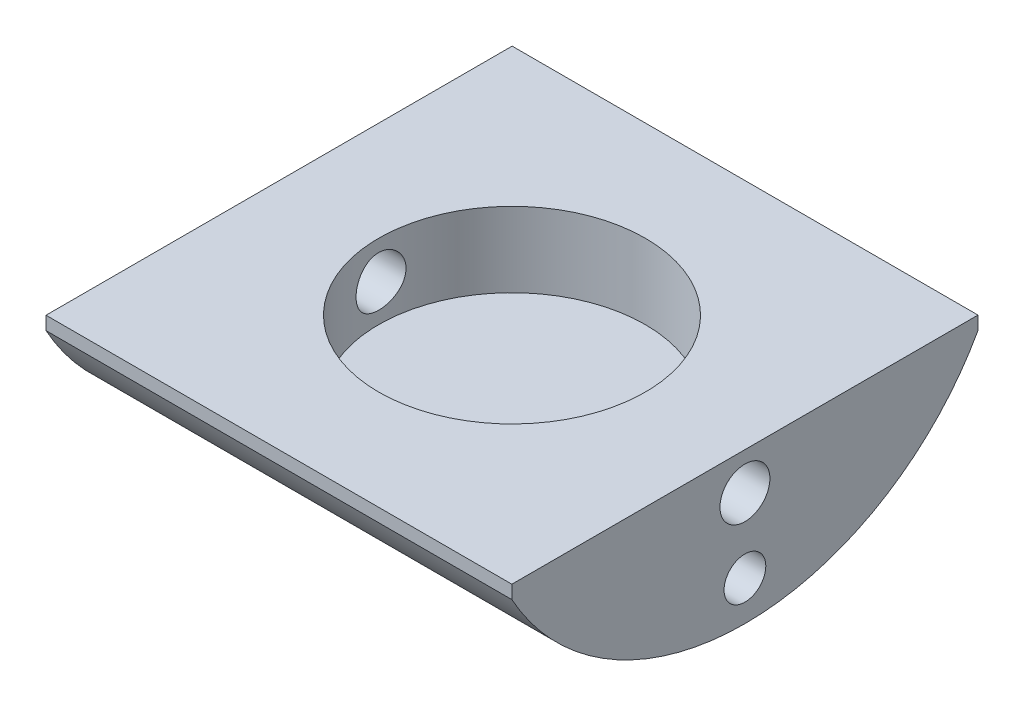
ISO-10303-21;
HEADER;
FILE_DESCRIPTION(('STEP AP214'),'2;1');
FILE_NAME('part.step','',(''),(''),'','','');
FILE_SCHEMA(('AUTOMOTIVE_DESIGN { 1 0 10303 214 1 1 1 1 }'));
ENDSEC;
DATA;
#1=APPLICATION_CONTEXT('core data for automotive mechanical design processes');
#2=APPLICATION_PROTOCOL_DEFINITION('international standard','automotive_design',2000,#1);
#3=PRODUCT_CONTEXT('',#1,'mechanical');
#4=PRODUCT('Part','Part','',(#3));
#5=PRODUCT_RELATED_PRODUCT_CATEGORY('part','',(#4));
#6=PRODUCT_DEFINITION_FORMATION('','',#4);
#7=PRODUCT_DEFINITION_CONTEXT('part definition',#1,'design');
#8=PRODUCT_DEFINITION('design','',#6,#7);
#9=PRODUCT_DEFINITION_SHAPE('','',#8);
#10=(LENGTH_UNIT() NAMED_UNIT(*) SI_UNIT(.MILLI.,.METRE.));
#11=(NAMED_UNIT(*) PLANE_ANGLE_UNIT() SI_UNIT($,.RADIAN.));
#12=(NAMED_UNIT(*) SI_UNIT($,.STERADIAN.) SOLID_ANGLE_UNIT());
#13=UNCERTAINTY_MEASURE_WITH_UNIT(LENGTH_MEASURE(1.E-05),#10,'distance_accuracy_value','');
#14=(GEOMETRIC_REPRESENTATION_CONTEXT(3) GLOBAL_UNCERTAINTY_ASSIGNED_CONTEXT((#13)) GLOBAL_UNIT_ASSIGNED_CONTEXT((#10,
#11,#12)) REPRESENTATION_CONTEXT('',''));
#15=CARTESIAN_POINT('',(0.,0.,0.));
#16=DIRECTION('',(0.,0.,1.));
#17=DIRECTION('',(1.,0.,0.));
#18=AXIS2_PLACEMENT_3D('',#15,#16,#17);
#19=CARTESIAN_POINT('',(44.4246000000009,0.,44.45));
#20=DIRECTION('',(0.,0.,-1.));
#21=DIRECTION('',(0.,1.00000000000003,0.));
#22=AXIS2_PLACEMENT_3D('',#19,#20,#21);
#23=PLANE('',#22);
#24=DIRECTION('',(0.,-1.00000000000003,0.));
#25=VECTOR('',#24,1.);
#26=CARTESIAN_POINT('',(-44.4246000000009,0.,44.45));
#27=LINE('',#26,#25);
#28=CARTESIAN_POINT('',(-44.4246000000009,0.,44.45));
#29=VERTEX_POINT('',#28);
#30=CARTESIAN_POINT('',(-44.4246000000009,-2.54624424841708,44.45));
#31=VERTEX_POINT('',#30);
#32=EDGE_CURVE('E120',#29,#31,#27,.T.);
#33=ORIENTED_EDGE('',*,*,#32,.T.);
#34=DIRECTION('',(-1.00000000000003,0.,0.));
#35=VECTOR('',#34,1.);
#36=CARTESIAN_POINT('',(44.4246000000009,-2.54624424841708,44.45));
#37=LINE('',#36,#35);
#38=CARTESIAN_POINT('',(44.4246000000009,-2.54624424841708,44.45));
#39=VERTEX_POINT('',#38);
#40=EDGE_CURVE('E11',#39,#31,#37,.T.);
#41=ORIENTED_EDGE('',*,*,#40,.F.);
#42=DIRECTION('',(0.,-1.00000000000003,0.));
#43=VECTOR('',#42,1.);
#44=CARTESIAN_POINT('',(44.4246000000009,0.,44.45));
#45=LINE('',#44,#43);
#46=CARTESIAN_POINT('',(44.4246000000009,0.,44.45));
#47=VERTEX_POINT('',#46);
#48=EDGE_CURVE('E129',#47,#39,#45,.T.);
#49=ORIENTED_EDGE('',*,*,#48,.F.);
#50=DIRECTION('',(-1.00000000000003,0.,0.));
#51=VECTOR('',#50,1.);
#52=CARTESIAN_POINT('',(44.4246000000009,0.,44.45));
#53=LINE('',#52,#51);
#54=EDGE_CURVE('E135',#47,#29,#53,.T.);
#55=ORIENTED_EDGE('',*,*,#54,.T.);
#56=EDGE_LOOP('',(#33,#41,#49,#55));
#57=FACE_BOUND('',#56,.T.);
#58=ADVANCED_FACE('F36',(#57),#23,.F.);
#59=CARTESIAN_POINT('',(44.4246000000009,22.0472,0.));
#60=DIRECTION('',(-1.00000000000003,0.,0.));
#61=DIRECTION('',(0.,0.,1.));
#62=AXIS2_PLACEMENT_3D('',#59,#60,#61);
#63=CYLINDRICAL_SURFACE('',#62,50.8);
#64=CARTESIAN_POINT('',(-44.4246000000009,22.0472,0.));
#65=DIRECTION('',(1.00000000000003,0.,0.));
#66=DIRECTION('',(0.,0.,-1.));
#67=AXIS2_PLACEMENT_3D('',#64,#65,#66);
#68=CIRCLE('',#67,50.8);
#69=CARTESIAN_POINT('',(-44.4246000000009,-2.54624424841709,-44.45));
#70=VERTEX_POINT('',#69);
#71=EDGE_CURVE('E123',#31,#70,#68,.T.);
#72=ORIENTED_EDGE('',*,*,#71,.T.);
#73=DIRECTION('',(-1.00000000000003,0.,0.));
#74=VECTOR('',#73,1.);
#75=CARTESIAN_POINT('',(44.4246000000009,-2.54624424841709,-44.45));
#76=LINE('',#75,#74);
#77=CARTESIAN_POINT('',(44.4246000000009,-2.54624424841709,-44.45));
#78=VERTEX_POINT('',#77);
#79=EDGE_CURVE('E49',#78,#70,#76,.T.);
#80=ORIENTED_EDGE('',*,*,#79,.F.);
#81=CARTESIAN_POINT('',(44.4246000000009,22.0472,0.));
#82=DIRECTION('',(1.00000000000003,0.,0.));
#83=DIRECTION('',(0.,0.,-1.));
#84=AXIS2_PLACEMENT_3D('',#81,#82,#83);
#85=CIRCLE('',#84,50.8);
#86=EDGE_CURVE('E131',#39,#78,#85,.T.);
#87=ORIENTED_EDGE('',*,*,#86,.F.);
#88=ORIENTED_EDGE('',*,*,#40,.T.);
#89=EDGE_LOOP('',(#72,#80,#87,#88));
#90=FACE_BOUND('',#89,.T.);
#91=ADVANCED_FACE('F170',(#90),#63,.T.);
#92=CARTESIAN_POINT('',(44.4246000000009,-2.54624424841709,-44.45));
#93=DIRECTION('',(0.,0.,1.));
#94=DIRECTION('',(0.,-1.00000000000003,0.));
#95=AXIS2_PLACEMENT_3D('',#92,#93,#94);
#96=PLANE('',#95);
#97=DIRECTION('',(0.,1.00000000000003,0.));
#98=VECTOR('',#97,1.);
#99=CARTESIAN_POINT('',(-44.4246000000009,-2.54624424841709,-44.45));
#100=LINE('',#99,#98);
#101=CARTESIAN_POINT('',(-44.4246000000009,0.,-44.45));
#102=VERTEX_POINT('',#101);
#103=EDGE_CURVE('E125',#70,#102,#100,.T.);
#104=ORIENTED_EDGE('',*,*,#103,.T.);
#105=DIRECTION('',(-1.00000000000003,0.,0.));
#106=VECTOR('',#105,1.);
#107=CARTESIAN_POINT('',(44.4246000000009,0.,-44.45));
#108=LINE('',#107,#106);
#109=CARTESIAN_POINT('',(44.4246000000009,0.,-44.45));
#110=VERTEX_POINT('',#109);
#111=EDGE_CURVE('E138',#110,#102,#108,.T.);
#112=ORIENTED_EDGE('',*,*,#111,.F.);
#113=DIRECTION('',(0.,1.00000000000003,0.));
#114=VECTOR('',#113,1.);
#115=CARTESIAN_POINT('',(44.4246000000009,-2.54624424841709,-44.45));
#116=LINE('',#115,#114);
#117=EDGE_CURVE('E62',#78,#110,#116,.T.);
#118=ORIENTED_EDGE('',*,*,#117,.F.);
#119=ORIENTED_EDGE('',*,*,#79,.T.);
#120=EDGE_LOOP('',(#104,#112,#118,#119));
#121=FACE_BOUND('',#120,.T.);
#122=ADVANCED_FACE('F175',(#121),#96,.F.);
#123=CARTESIAN_POINT('',(44.4246000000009,0.,44.45));
#124=DIRECTION('',(0.,-1.00000000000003,0.));
#125=DIRECTION('',(0.,0.,-1.));
#126=AXIS2_PLACEMENT_3D('',#123,#124,#125);
#127=PLANE('',#126);
#128=CARTESIAN_POINT('',(0.,0.,0.));
#129=DIRECTION('',(0.,1.00000000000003,0.));
#130=DIRECTION('',(0.,0.,1.));
#131=AXIS2_PLACEMENT_3D('',#128,#129,#130);
#132=CIRCLE('',#131,25.4254);
#133=CARTESIAN_POINT('',(0.,0.,25.4254));
#134=VERTEX_POINT('',#133);
#135=EDGE_CURVE('E114',#134,#134,#132,.T.);
#136=ORIENTED_EDGE('',*,*,#135,.F.);
#137=EDGE_LOOP('',(#136));
#138=FACE_BOUND('',#137,.T.);
#139=DIRECTION('',(0.,0.,1.));
#140=VECTOR('',#139,1.);
#141=CARTESIAN_POINT('',(-44.4246000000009,0.,44.45));
#142=LINE('',#141,#140);
#143=EDGE_CURVE('E127',#102,#29,#142,.T.);
#144=ORIENTED_EDGE('',*,*,#143,.T.);
#145=ORIENTED_EDGE('',*,*,#54,.F.);
#146=DIRECTION('',(0.,0.,1.));
#147=VECTOR('',#146,1.);
#148=CARTESIAN_POINT('',(44.4246000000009,0.,44.45));
#149=LINE('',#148,#147);
#150=EDGE_CURVE('E57',#110,#47,#149,.T.);
#151=ORIENTED_EDGE('',*,*,#150,.F.);
#152=ORIENTED_EDGE('',*,*,#111,.T.);
#153=EDGE_LOOP('',(#144,#145,#151,#152));
#154=FACE_BOUND('',#153,.T.);
#155=ADVANCED_FACE('F186',(#138,#154),#127,.F.);
#156=CARTESIAN_POINT('',(44.4246000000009,22.0472,0.));
#157=DIRECTION('',(1.00000000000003,0.,0.));
#158=DIRECTION('',(0.,0.,-1.));
#159=AXIS2_PLACEMENT_3D('',#156,#157,#158);
#160=PLANE('',#159);
#161=CARTESIAN_POINT('',(44.4246000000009,-21.209,0.));
#162=DIRECTION('',(1.00000000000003,0.,0.));
#163=DIRECTION('',(0.,0.,-1.));
#164=AXIS2_PLACEMENT_3D('',#161,#162,#163);
#165=CIRCLE('',#164,3.98145);
#166=CARTESIAN_POINT('',(44.4246000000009,-21.209,-3.98145));
#167=VERTEX_POINT('',#166);
#168=EDGE_CURVE('E104',#167,#167,#165,.T.);
#169=ORIENTED_EDGE('',*,*,#168,.F.);
#170=EDGE_LOOP('',(#169));
#171=FACE_BOUND('',#170,.T.);
#172=CARTESIAN_POINT('',(44.4246000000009,-7.1374,0.));
#173=DIRECTION('',(1.00000000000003,0.,0.));
#174=DIRECTION('',(0.,0.,-1.));
#175=AXIS2_PLACEMENT_3D('',#172,#173,#174);
#176=CIRCLE('',#175,4.76249999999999);
#177=CARTESIAN_POINT('',(44.4246000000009,-7.1374,-4.76249999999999));
#178=VERTEX_POINT('',#177);
#179=EDGE_CURVE('E110',#178,#178,#176,.T.);
#180=ORIENTED_EDGE('',*,*,#179,.F.);
#181=EDGE_LOOP('',(#180));
#182=FACE_BOUND('',#181,.T.);
#183=ORIENTED_EDGE('',*,*,#48,.T.);
#184=ORIENTED_EDGE('',*,*,#86,.T.);
#185=ORIENTED_EDGE('',*,*,#117,.T.);
#186=ORIENTED_EDGE('',*,*,#150,.T.);
#187=EDGE_LOOP('',(#183,#184,#185,#186));
#188=FACE_BOUND('',#187,.T.);
#189=ADVANCED_FACE('F184',(#171,#182,#188),#160,.T.);
#190=CARTESIAN_POINT('',(-44.4246000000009,22.0472,0.));
#191=DIRECTION('',(1.00000000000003,0.,0.));
#192=DIRECTION('',(0.,0.,-1.));
#193=AXIS2_PLACEMENT_3D('',#190,#191,#192);
#194=PLANE('',#193);
#195=CARTESIAN_POINT('',(-44.4246000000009,-21.209,0.));
#196=DIRECTION('',(-1.00000000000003,0.,0.));
#197=DIRECTION('',(0.,0.,1.));
#198=AXIS2_PLACEMENT_3D('',#195,#196,#197);
#199=CIRCLE('',#198,3.98145);
#200=CARTESIAN_POINT('',(-44.4246000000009,-21.209,3.98145));
#201=VERTEX_POINT('',#200);
#202=EDGE_CURVE('E96',#201,#201,#199,.T.);
#203=ORIENTED_EDGE('',*,*,#202,.F.);
#204=EDGE_LOOP('',(#203));
#205=FACE_BOUND('',#204,.T.);
#206=CARTESIAN_POINT('',(-44.4246000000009,-7.1374,0.));
#207=DIRECTION('',(1.00000000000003,0.,0.));
#208=DIRECTION('',(0.,0.,-1.));
#209=AXIS2_PLACEMENT_3D('',#206,#207,#208);
#210=CIRCLE('',#209,4.76249999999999);
#211=CARTESIAN_POINT('',(-44.4246000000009,-7.1374,-4.76249999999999));
#212=VERTEX_POINT('',#211);
#213=EDGE_CURVE('E107',#212,#212,#210,.T.);
#214=ORIENTED_EDGE('',*,*,#213,.T.);
#215=EDGE_LOOP('',(#214));
#216=FACE_BOUND('',#215,.T.);
#217=ORIENTED_EDGE('',*,*,#32,.F.);
#218=ORIENTED_EDGE('',*,*,#143,.F.);
#219=ORIENTED_EDGE('',*,*,#103,.F.);
#220=ORIENTED_EDGE('',*,*,#71,.F.);
#221=EDGE_LOOP('',(#217,#218,#219,#220));
#222=FACE_BOUND('',#221,.T.);
#223=ADVANCED_FACE('F167',(#205,#216,#222),#194,.F.);
#224=CARTESIAN_POINT('',(0.,-14.2748,0.));
#225=DIRECTION('',(0.,1.00000000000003,0.));
#226=DIRECTION('',(0.,0.,1.));
#227=AXIS2_PLACEMENT_3D('',#224,#225,#226);
#228=CYLINDRICAL_SURFACE('',#227,25.4254);
#229=CARTESIAN_POINT('',(-24.9753790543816,-7.1374,-4.76249999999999));
#230=CARTESIAN_POINT('',(-24.9753841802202,-7.40238172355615,-4.76248983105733));
#231=CARTESIAN_POINT('',(-24.9796419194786,-7.66749543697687,-4.74030991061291));
#232=CARTESIAN_POINT('',(-24.9961916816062,-8.19024763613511,-4.65223587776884));
#233=CARTESIAN_POINT('',(-25.0084905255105,-8.44787958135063,-4.58630465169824));
#234=CARTESIAN_POINT('',(-25.0396818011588,-8.94802880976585,-4.41282350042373));
#235=CARTESIAN_POINT('',(-25.0585680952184,-9.19055991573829,-4.30531230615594));
#236=CARTESIAN_POINT('',(-25.100798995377,-9.65412752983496,-4.05182558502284));
#237=CARTESIAN_POINT('',(-25.1241432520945,-9.87516572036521,-3.90585307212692));
#238=CARTESIAN_POINT('',(-25.1729836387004,-10.2922351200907,-3.57765471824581));
#239=CARTESIAN_POINT('',(-25.1985008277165,-10.4879606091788,-3.39504344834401));
#240=CARTESIAN_POINT('',(-25.248625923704,-10.8461850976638,-2.99958423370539));
#241=CARTESIAN_POINT('',(-25.2732337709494,-11.0086819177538,-2.78673430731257));
#242=CARTESIAN_POINT('',(-25.3189931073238,-11.29700763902,-2.33483204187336));
#243=CARTESIAN_POINT('',(-25.3401168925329,-11.4225483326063,-2.09559277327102));
#244=CARTESIAN_POINT('',(-25.3762923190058,-11.6315413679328,-1.59895690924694));
#245=CARTESIAN_POINT('',(-25.3913444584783,-11.7149971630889,-1.34156180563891));
#246=CARTESIAN_POINT('',(-25.413531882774,-11.8365061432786,-0.819088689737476));
#247=CARTESIAN_POINT('',(-25.4207569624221,-11.8750746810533,-0.554134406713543));
#248=CARTESIAN_POINT('',(-25.4267856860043,-11.9073200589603,-0.0214238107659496));
#249=CARTESIAN_POINT('',(-25.4255900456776,-11.9010007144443,0.246332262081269));
#250=CARTESIAN_POINT('',(-25.4149822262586,-11.844045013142,0.773511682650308));
#251=CARTESIAN_POINT('',(-25.4056729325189,-11.7939635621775,1.03299735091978));
#252=CARTESIAN_POINT('',(-25.3799992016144,-11.6517828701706,1.53981561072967));
#253=CARTESIAN_POINT('',(-25.3636345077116,-11.5596821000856,1.78714775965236));
#254=CARTESIAN_POINT('',(-25.3255167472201,-11.3355482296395,2.26424807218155));
#255=CARTESIAN_POINT('',(-25.3037338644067,-11.2032932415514,2.49390951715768));
#256=CARTESIAN_POINT('',(-25.2571887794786,-10.9027686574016,2.92798702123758));
#257=CARTESIAN_POINT('',(-25.2324262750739,-10.7344954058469,3.13240051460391));
#258=CARTESIAN_POINT('',(-25.1822175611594,-10.3636529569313,3.51346723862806));
#259=CARTESIAN_POINT('',(-25.1567666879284,-10.1605982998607,3.68964774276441));
#260=CARTESIAN_POINT('',(-25.1084119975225,-9.72757435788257,4.00552427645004));
#261=CARTESIAN_POINT('',(-25.0855082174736,-9.49760468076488,4.14521977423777));
#262=CARTESIAN_POINT('',(-25.0448342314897,-9.01665262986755,4.38429526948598));
#263=CARTESIAN_POINT('',(-25.0270727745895,-8.76563537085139,4.48360667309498));
#264=CARTESIAN_POINT('',(-24.99882852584,-8.25007052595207,4.63851259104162));
#265=CARTESIAN_POINT('',(-24.9883449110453,-7.9855244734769,4.69411204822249));
#266=CARTESIAN_POINT('',(-24.9760061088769,-7.45467401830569,4.75932582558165));
#267=CARTESIAN_POINT('',(-24.9740235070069,-7.18845591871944,4.76961926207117));
#268=CARTESIAN_POINT('',(-24.9785702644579,-6.65810482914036,4.74574915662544));
#269=CARTESIAN_POINT('',(-24.9850992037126,-6.39397173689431,4.7115878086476));
#270=CARTESIAN_POINT('',(-25.0058147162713,-5.87752038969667,4.60036081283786));
#271=CARTESIAN_POINT('',(-25.0199377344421,-5.62512270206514,4.52365108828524));
#272=CARTESIAN_POINT('',(-25.0541953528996,-5.13676273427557,4.3298824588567));
#273=CARTESIAN_POINT('',(-25.0743303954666,-4.90080166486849,4.21282058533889));
#274=CARTESIAN_POINT('',(-25.1186335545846,-4.4490208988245,3.94010719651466));
#275=CARTESIAN_POINT('',(-25.142845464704,-4.23346457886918,3.78402661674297));
#276=CARTESIAN_POINT('',(-25.1924510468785,-3.83135641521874,3.43828504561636));
#277=CARTESIAN_POINT('',(-25.2178448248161,-3.64480717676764,3.2486210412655));
#278=CARTESIAN_POINT('',(-25.267362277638,-3.30347199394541,2.83806358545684));
#279=CARTESIAN_POINT('',(-25.2914645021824,-3.14914274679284,2.61678744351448));
#280=CARTESIAN_POINT('',(-25.3353223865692,-2.87985134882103,2.15105378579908));
#281=CARTESIAN_POINT('',(-25.3550782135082,-2.76488768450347,1.90659716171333));
#282=CARTESIAN_POINT('',(-25.3879251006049,-2.57827476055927,1.40270452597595));
#283=CARTESIAN_POINT('',(-25.4010506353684,-2.50640107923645,1.14335397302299));
#284=CARTESIAN_POINT('',(-25.4193050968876,-2.40729208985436,0.615993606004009));
#285=CARTESIAN_POINT('',(-25.4244348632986,-2.38005209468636,0.347984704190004));
#286=CARTESIAN_POINT('',(-25.4261031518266,-2.37114663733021,-0.184704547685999));
#287=CARTESIAN_POINT('',(-25.422771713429,-2.38879135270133,-0.449373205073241));
#288=CARTESIAN_POINT('',(-25.4081620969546,-2.46764380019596,-0.971903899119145));
#289=CARTESIAN_POINT('',(-25.3968839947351,-2.52885111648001,-1.2297660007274));
#290=CARTESIAN_POINT('',(-25.3676481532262,-2.69280088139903,-1.73100018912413));
#291=CARTESIAN_POINT('',(-25.3497022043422,-2.79547004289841,-1.97439697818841));
#292=CARTESIAN_POINT('',(-25.3090735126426,-3.03934645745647,-2.44061191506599));
#293=CARTESIAN_POINT('',(-25.2863904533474,-3.18055628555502,-2.66342868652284));
#294=CARTESIAN_POINT('',(-25.2383815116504,-3.4998806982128,-3.08559640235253));
#295=CARTESIAN_POINT('',(-25.2130225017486,-3.67849370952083,-3.28456661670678));
#296=CARTESIAN_POINT('',(-25.1627290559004,-4.06651997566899,-3.64994963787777));
#297=CARTESIAN_POINT('',(-25.1377947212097,-4.27594046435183,-3.81635477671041));
#298=CARTESIAN_POINT('',(-25.0909222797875,-4.7219495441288,-4.11332694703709));
#299=CARTESIAN_POINT('',(-25.0690139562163,-4.95877108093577,-4.24354897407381));
#300=CARTESIAN_POINT('',(-25.0310323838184,-5.4512639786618,-4.46215129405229));
#301=CARTESIAN_POINT('',(-25.0149536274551,-5.70691727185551,-4.55057110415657));
#302=CARTESIAN_POINT('',(-24.9938062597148,-6.15900617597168,-4.66507771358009));
#303=CARTESIAN_POINT('',(-24.9869370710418,-6.35279413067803,-4.70154849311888));
#304=CARTESIAN_POINT('',(-24.9777216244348,-6.74349713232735,-4.75026308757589));
#305=CARTESIAN_POINT('',(-24.9753752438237,-6.94041209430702,-4.76250755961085));
#306=CARTESIAN_POINT('',(-24.9753790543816,-7.1374,-4.76249999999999));
#307=B_SPLINE_CURVE_WITH_KNOTS('',3,(#229,#230,#231,#232,#233,#234,#235,#236,#237,#238,#239,
#240,#241,#242,#243,#244,#245,#246,#247,#248,#249,#250,#251,#252,#253,#254,#255,#256,#257,#258,
#259,#260,#261,#262,#263,#264,#265,#266,#267,#268,#269,#270,#271,#272,#273,#274,#275,#276,#277,
#278,#279,#280,#281,#282,#283,#284,#285,#286,#287,#288,#289,#290,#291,#292,#293,#294,#295,#296,
#297,#298,#299,#300,#301,#302,#303,#304,#305,#306),.UNSPECIFIED.,.T.,.F.,(4,2,2,2,2,2,2,2,2,2,2,
2,2,2,2,2,2,2,2,2,2,2,2,2,2,2,2,2,2,2,2,2,2,2,2,2,2,2,4),(0.,0.794224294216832,1.5891231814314,
2.38328341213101,3.17738142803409,3.98031804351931,4.78330730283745,5.5924022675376,
6.40143082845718,7.20107629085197,8.00065378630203,8.79023735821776,9.57984966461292,
10.373907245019,11.1680454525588,11.9743373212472,12.78064094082,13.5883084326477,
14.39588458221,15.1913133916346,15.9867029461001,16.7755371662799,17.5644294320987,
18.3624107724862,19.1604637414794,19.9691579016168,20.7778209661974,21.5822349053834,
22.3865643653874,23.1786072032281,23.9706424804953,24.7612838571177,25.551978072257,
26.3539687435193,27.1561480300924,27.9657323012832,28.774549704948,29.364993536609,
29.9554213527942),.UNSPECIFIED.);
#308=CARTESIAN_POINT('',(-24.9753790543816,-7.1374,-4.76249999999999));
#309=VERTEX_POINT('',#308);
#310=EDGE_CURVE('E39',#309,#309,#307,.T.);
#311=ORIENTED_EDGE('',*,*,#310,.T.);
#312=EDGE_LOOP('',(#311));
#313=FACE_BOUND('',#312,.T.);
#314=CARTESIAN_POINT('',(24.9753790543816,-7.1374,-4.76249999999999));
#315=CARTESIAN_POINT('',(24.9753841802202,-6.87241827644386,-4.76248983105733));
#316=CARTESIAN_POINT('',(24.9796419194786,-6.60730456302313,-4.74030991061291));
#317=CARTESIAN_POINT('',(24.9961916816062,-6.08455236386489,-4.65223587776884));
#318=CARTESIAN_POINT('',(25.0084905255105,-5.82692041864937,-4.58630465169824));
#319=CARTESIAN_POINT('',(25.0396818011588,-5.32677119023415,-4.41282350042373));
#320=CARTESIAN_POINT('',(25.0585680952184,-5.08424008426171,-4.30531230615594));
#321=CARTESIAN_POINT('',(25.100798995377,-4.62067247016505,-4.05182558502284));
#322=CARTESIAN_POINT('',(25.1241432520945,-4.3996342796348,-3.90585307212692));
#323=CARTESIAN_POINT('',(25.1729836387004,-3.98256487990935,-3.57765471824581));
#324=CARTESIAN_POINT('',(25.1985008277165,-3.78683939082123,-3.39504344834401));
#325=CARTESIAN_POINT('',(25.248625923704,-3.42861490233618,-2.99958423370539));
#326=CARTESIAN_POINT('',(25.2732337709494,-3.26611808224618,-2.78673430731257));
#327=CARTESIAN_POINT('',(25.3189931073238,-2.97779236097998,-2.33483204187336));
#328=CARTESIAN_POINT('',(25.3401168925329,-2.85225166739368,-2.09559277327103));
#329=CARTESIAN_POINT('',(25.3762923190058,-2.64325863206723,-1.59895690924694));
#330=CARTESIAN_POINT('',(25.3913444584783,-2.55980283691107,-1.34156180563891));
#331=CARTESIAN_POINT('',(25.413531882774,-2.43829385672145,-0.819088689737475));
#332=CARTESIAN_POINT('',(25.4207569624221,-2.39972531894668,-0.554134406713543));
#333=CARTESIAN_POINT('',(25.4267856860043,-2.36747994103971,-0.0214238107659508));
#334=CARTESIAN_POINT('',(25.4255900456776,-2.37379928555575,0.246332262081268));
#335=CARTESIAN_POINT('',(25.4149822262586,-2.43075498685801,0.773511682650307));
#336=CARTESIAN_POINT('',(25.4056729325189,-2.48083643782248,1.03299735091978));
#337=CARTESIAN_POINT('',(25.3799992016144,-2.62301712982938,1.53981561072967));
#338=CARTESIAN_POINT('',(25.3636345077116,-2.71511789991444,1.78714775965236));
#339=CARTESIAN_POINT('',(25.3255167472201,-2.93925177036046,2.26424807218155));
#340=CARTESIAN_POINT('',(25.3037338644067,-3.07150675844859,2.49390951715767));
#341=CARTESIAN_POINT('',(25.2571887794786,-3.37203134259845,2.92798702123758));
#342=CARTESIAN_POINT('',(25.2324262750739,-3.54030459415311,3.1324005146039));
#343=CARTESIAN_POINT('',(25.1822175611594,-3.91114704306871,3.51346723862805));
#344=CARTESIAN_POINT('',(25.1567666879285,-4.11420170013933,3.68964774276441));
#345=CARTESIAN_POINT('',(25.1084119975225,-4.54722564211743,4.00552427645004));
#346=CARTESIAN_POINT('',(25.0855082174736,-4.77719531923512,4.14521977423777));
#347=CARTESIAN_POINT('',(25.0448342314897,-5.25814737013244,4.38429526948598));
#348=CARTESIAN_POINT('',(25.0270727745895,-5.50916462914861,4.48360667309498));
#349=CARTESIAN_POINT('',(24.99882852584,-6.02472947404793,4.63851259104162));
#350=CARTESIAN_POINT('',(24.9883449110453,-6.28927552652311,4.69411204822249));
#351=CARTESIAN_POINT('',(24.9760061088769,-6.82012598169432,4.75932582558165));
#352=CARTESIAN_POINT('',(24.9740235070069,-7.08634408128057,4.76961926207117));
#353=CARTESIAN_POINT('',(24.9785702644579,-7.61669517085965,4.74574915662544));
#354=CARTESIAN_POINT('',(24.9850992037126,-7.8808282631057,4.7115878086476));
#355=CARTESIAN_POINT('',(25.0058147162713,-8.39727961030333,4.60036081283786));
#356=CARTESIAN_POINT('',(25.0199377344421,-8.64967729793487,4.52365108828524));
#357=CARTESIAN_POINT('',(25.0541953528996,-9.13803726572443,4.3298824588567));
#358=CARTESIAN_POINT('',(25.0743303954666,-9.37399833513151,4.2128205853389));
#359=CARTESIAN_POINT('',(25.1186335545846,-9.8257791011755,3.94010719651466));
#360=CARTESIAN_POINT('',(25.142845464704,-10.0413354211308,3.78402661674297));
#361=CARTESIAN_POINT('',(25.1924510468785,-10.4434435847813,3.43828504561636));
#362=CARTESIAN_POINT('',(25.2178448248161,-10.6299928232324,3.24862104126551));
#363=CARTESIAN_POINT('',(25.267362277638,-10.9713280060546,2.83806358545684));
#364=CARTESIAN_POINT('',(25.2914645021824,-11.1256572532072,2.61678744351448));
#365=CARTESIAN_POINT('',(25.3353223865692,-11.394948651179,2.15105378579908));
#366=CARTESIAN_POINT('',(25.3550782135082,-11.5099123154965,1.90659716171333));
#367=CARTESIAN_POINT('',(25.3879251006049,-11.6965252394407,1.40270452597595));
#368=CARTESIAN_POINT('',(25.4010506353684,-11.7683989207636,1.143353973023));
#369=CARTESIAN_POINT('',(25.4193050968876,-11.8675079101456,0.615993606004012));
#370=CARTESIAN_POINT('',(25.4244348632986,-11.8947479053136,0.347984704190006));
#371=CARTESIAN_POINT('',(25.4261031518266,-11.9036533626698,-0.184704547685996));
#372=CARTESIAN_POINT('',(25.422771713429,-11.8860086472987,-0.449373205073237));
#373=CARTESIAN_POINT('',(25.4081620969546,-11.807156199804,-0.971903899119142));
#374=CARTESIAN_POINT('',(25.3968839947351,-11.74594888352,-1.22976600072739));
#375=CARTESIAN_POINT('',(25.3676481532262,-11.581999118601,-1.73100018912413));
#376=CARTESIAN_POINT('',(25.3497022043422,-11.4793299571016,-1.97439697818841));
#377=CARTESIAN_POINT('',(25.3090735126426,-11.2354535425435,-2.44061191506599));
#378=CARTESIAN_POINT('',(25.2863904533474,-11.094243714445,-2.66342868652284));
#379=CARTESIAN_POINT('',(25.2383815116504,-10.7749193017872,-3.08559640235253));
#380=CARTESIAN_POINT('',(25.2130225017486,-10.5963062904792,-3.28456661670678));
#381=CARTESIAN_POINT('',(25.1627290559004,-10.208280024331,-3.64994963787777));
#382=CARTESIAN_POINT('',(25.1377947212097,-9.99885953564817,-3.81635477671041));
#383=CARTESIAN_POINT('',(25.0909222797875,-9.55285045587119,-4.11332694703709));
#384=CARTESIAN_POINT('',(25.0690139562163,-9.31602891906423,-4.24354897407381));
#385=CARTESIAN_POINT('',(25.0310323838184,-8.8235360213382,-4.46215129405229));
#386=CARTESIAN_POINT('',(25.0149536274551,-8.56788272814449,-4.55057110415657));
#387=CARTESIAN_POINT('',(24.9938062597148,-8.11579382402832,-4.66507771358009));
#388=CARTESIAN_POINT('',(24.9869370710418,-7.92200586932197,-4.70154849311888));
#389=CARTESIAN_POINT('',(24.9777216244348,-7.53130286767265,-4.75026308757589));
#390=CARTESIAN_POINT('',(24.9753752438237,-7.33438790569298,-4.76250755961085));
#391=CARTESIAN_POINT('',(24.9753790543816,-7.1374,-4.76249999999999));
#392=B_SPLINE_CURVE_WITH_KNOTS('',3,(#314,#315,#316,#317,#318,#319,#320,#321,#322,#323,#324,
#325,#326,#327,#328,#329,#330,#331,#332,#333,#334,#335,#336,#337,#338,#339,#340,#341,#342,#343,
#344,#345,#346,#347,#348,#349,#350,#351,#352,#353,#354,#355,#356,#357,#358,#359,#360,#361,#362,
#363,#364,#365,#366,#367,#368,#369,#370,#371,#372,#373,#374,#375,#376,#377,#378,#379,#380,#381,
#382,#383,#384,#385,#386,#387,#388,#389,#390,#391),.UNSPECIFIED.,.T.,.F.,(4,2,2,2,2,2,2,2,2,2,2,
2,2,2,2,2,2,2,2,2,2,2,2,2,2,2,2,2,2,2,2,2,2,2,2,2,2,2,4),(0.,0.794224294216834,1.58912318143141,
2.38328341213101,3.17738142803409,3.98031804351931,4.78330730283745,5.5924022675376,
6.40143082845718,7.20107629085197,8.00065378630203,8.79023735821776,9.57984966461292,
10.373907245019,11.1680454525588,11.9743373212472,12.78064094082,13.5883084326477,
14.39588458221,15.1913133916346,15.9867029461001,16.7755371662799,17.5644294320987,
18.3624107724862,19.1604637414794,19.9691579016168,20.7778209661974,21.5822349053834,
22.3865643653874,23.1786072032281,23.9706424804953,24.7612838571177,25.551978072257,
26.3539687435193,27.1561480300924,27.9657323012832,28.774549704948,29.364993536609,
29.9554213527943),.UNSPECIFIED.);
#393=CARTESIAN_POINT('',(24.9753790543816,-7.1374,-4.76249999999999));
#394=VERTEX_POINT('',#393);
#395=EDGE_CURVE('E113',#394,#394,#392,.T.);
#396=ORIENTED_EDGE('',*,*,#395,.T.);
#397=EDGE_LOOP('',(#396));
#398=FACE_BOUND('',#397,.T.);
#399=CARTESIAN_POINT('',(0.,-14.2748,0.));
#400=DIRECTION('',(0.,1.00000000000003,0.));
#401=DIRECTION('',(0.,0.,1.));
#402=AXIS2_PLACEMENT_3D('',#399,#400,#401);
#403=CIRCLE('',#402,25.4254);
#404=CARTESIAN_POINT('',(0.,-14.2748,25.4254));
#405=VERTEX_POINT('',#404);
#406=EDGE_CURVE('E117',#405,#405,#403,.T.);
#407=ORIENTED_EDGE('',*,*,#406,.F.);
#408=EDGE_LOOP('',(#407));
#409=FACE_BOUND('',#408,.T.);
#410=ORIENTED_EDGE('',*,*,#135,.T.);
#411=EDGE_LOOP('',(#410));
#412=FACE_BOUND('',#411,.T.);
#413=ADVANCED_FACE('F146',(#313,#398,#409,#412),#228,.F.);
#414=CARTESIAN_POINT('',(0.,-14.2748,0.));
#415=DIRECTION('',(0.,1.00000000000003,0.));
#416=DIRECTION('',(0.,0.,1.));
#417=AXIS2_PLACEMENT_3D('',#414,#415,#416);
#418=PLANE('',#417);
#419=ORIENTED_EDGE('',*,*,#406,.T.);
#420=EDGE_LOOP('',(#419));
#421=FACE_BOUND('',#420,.T.);
#422=ADVANCED_FACE('F158',(#421),#418,.T.);
#423=CARTESIAN_POINT('',(44.4246000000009,-7.1374,0.));
#424=DIRECTION('',(1.00000000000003,0.,0.));
#425=DIRECTION('',(0.,0.,-1.));
#426=AXIS2_PLACEMENT_3D('',#423,#424,#425);
#427=CYLINDRICAL_SURFACE('',#426,4.76249999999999);
#428=ORIENTED_EDGE('',*,*,#179,.T.);
#429=EDGE_LOOP('',(#428));
#430=FACE_BOUND('',#429,.T.);
#431=ORIENTED_EDGE('',*,*,#395,.F.);
#432=EDGE_LOOP('',(#431));
#433=FACE_BOUND('',#432,.T.);
#434=ADVANCED_FACE('F155',(#430,#433),#427,.F.);
#435=ORIENTED_EDGE('',*,*,#213,.F.);
#436=EDGE_LOOP('',(#435));
#437=FACE_BOUND('',#436,.T.);
#438=ORIENTED_EDGE('',*,*,#310,.F.);
#439=EDGE_LOOP('',(#438));
#440=FACE_BOUND('',#439,.T.);
#441=ADVANCED_FACE('F150',(#437,#440),#427,.F.);
#442=CARTESIAN_POINT('',(44.4246000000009,-21.209,0.));
#443=DIRECTION('',(1.00000000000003,0.,0.));
#444=DIRECTION('',(0.,0.,-1.));
#445=AXIS2_PLACEMENT_3D('',#442,#443,#444);
#446=CYLINDRICAL_SURFACE('',#445,3.98145);
#447=CARTESIAN_POINT('',(23.7744000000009,-21.209,0.));
#448=DIRECTION('',(1.00000000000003,0.,0.));
#449=DIRECTION('',(0.,0.,-1.));
#450=AXIS2_PLACEMENT_3D('',#447,#448,#449);
#451=CIRCLE('',#450,3.98144999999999);
#452=CARTESIAN_POINT('',(23.7744000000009,-21.209,-3.98144999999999));
#453=VERTEX_POINT('',#452);
#454=EDGE_CURVE('E99',#453,#453,#451,.T.);
#455=ORIENTED_EDGE('',*,*,#454,.F.);
#456=EDGE_LOOP('',(#455));
#457=FACE_BOUND('',#456,.T.);
#458=ORIENTED_EDGE('',*,*,#168,.T.);
#459=EDGE_LOOP('',(#458));
#460=FACE_BOUND('',#459,.T.);
#461=ADVANCED_FACE('F154',(#457,#460),#446,.F.);
#462=CARTESIAN_POINT('',(23.7744000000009,-21.209,0.));
#463=DIRECTION('',(1.00000000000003,0.,0.));
#464=DIRECTION('',(0.,0.,-1.));
#465=AXIS2_PLACEMENT_3D('',#462,#463,#464);
#466=CONICAL_SURFACE('',#465,3.98144999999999,1.02974425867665);
#467=CARTESIAN_POINT('',(21.3821034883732,-21.209,0.));
#468=VERTEX_POINT('',#467);
#469=VERTEX_LOOP('',#468);
#470=FACE_BOUND('',#469,.T.);
#471=ORIENTED_EDGE('',*,*,#454,.T.);
#472=EDGE_LOOP('',(#471));
#473=FACE_BOUND('',#472,.T.);
#474=ADVANCED_FACE('F253',(#470,#473),#466,.F.);
#475=CARTESIAN_POINT('',(-44.4246000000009,-21.209,0.));
#476=DIRECTION('',(-1.00000000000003,0.,0.));
#477=DIRECTION('',(0.,0.,1.));
#478=AXIS2_PLACEMENT_3D('',#475,#476,#477);
#479=CYLINDRICAL_SURFACE('',#478,3.98145);
#480=CARTESIAN_POINT('',(-23.7744000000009,-21.209,0.));
#481=DIRECTION('',(-1.00000000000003,0.,0.));
#482=DIRECTION('',(0.,0.,1.));
#483=AXIS2_PLACEMENT_3D('',#480,#481,#482);
#484=CIRCLE('',#483,3.98144999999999);
#485=CARTESIAN_POINT('',(-23.7744000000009,-21.209,3.98144999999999));
#486=VERTEX_POINT('',#485);
#487=EDGE_CURVE('E94',#486,#486,#484,.T.);
#488=ORIENTED_EDGE('',*,*,#487,.F.);
#489=EDGE_LOOP('',(#488));
#490=FACE_BOUND('',#489,.T.);
#491=ORIENTED_EDGE('',*,*,#202,.T.);
#492=EDGE_LOOP('',(#491));
#493=FACE_BOUND('',#492,.T.);
#494=ADVANCED_FACE('F90',(#490,#493),#479,.F.);
#495=CARTESIAN_POINT('',(-23.7744000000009,-21.209,0.));
#496=DIRECTION('',(-1.00000000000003,0.,0.));
#497=DIRECTION('',(0.,0.,1.));
#498=AXIS2_PLACEMENT_3D('',#495,#496,#497);
#499=CONICAL_SURFACE('',#498,3.98144999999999,1.02974425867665);
#500=CARTESIAN_POINT('',(-21.3821034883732,-21.209,0.));
#501=VERTEX_POINT('',#500);
#502=VERTEX_LOOP('',#501);
#503=FACE_BOUND('',#502,.T.);
#504=ORIENTED_EDGE('',*,*,#487,.T.);
#505=EDGE_LOOP('',(#504));
#506=FACE_BOUND('',#505,.T.);
#507=ADVANCED_FACE('F87',(#503,#506),#499,.F.);
#508=CLOSED_SHELL('',(#58,#91,#122,#155,#189,#223,#413,#422,#434,#441,#461,#474,#494,#507));
#509=MANIFOLD_SOLID_BREP('B2',#508);
#510=ADVANCED_BREP_SHAPE_REPRESENTATION('',(#18,#509),#14);
#511=SHAPE_DEFINITION_REPRESENTATION(#9,#510);
ENDSEC;
END-ISO-10303-21;
